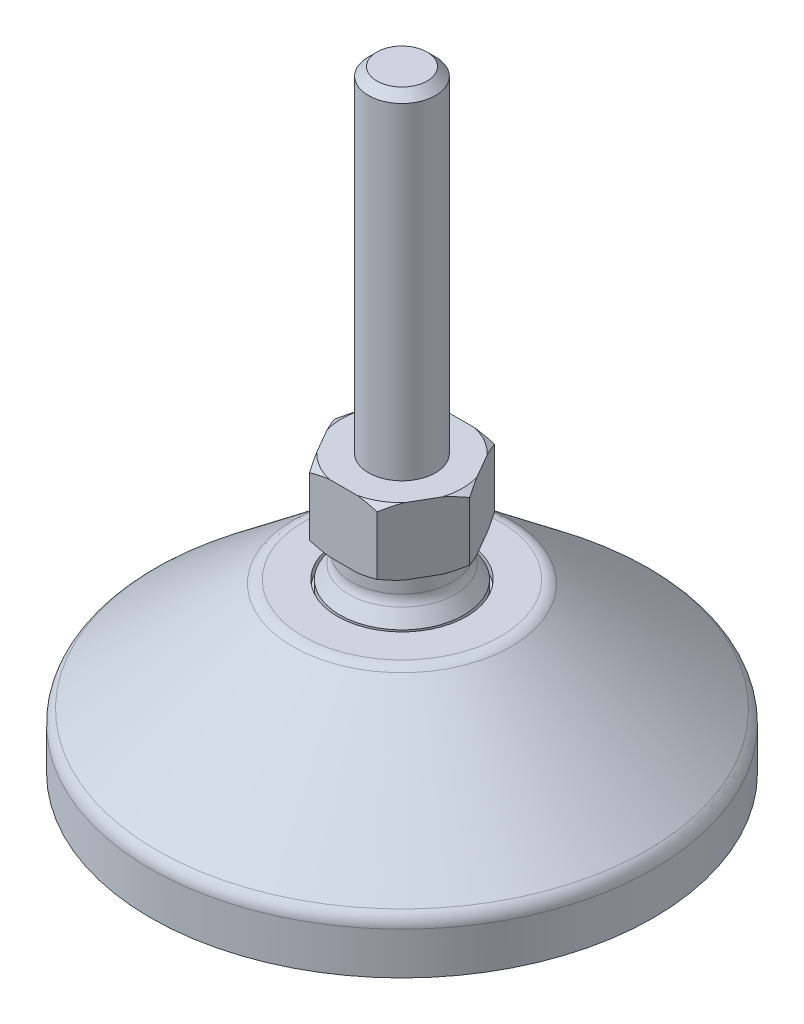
from build123d import *

# Parameters (mm, degrees)
SKETCH1_R           = 25.75
BOSS_EXTRUDE1_DEPTH = 2
SKETCH2_R           = 30
BOSS_EXTRUDE2_DEPTH = 6
SKETCH3_R           = 12.5
SKETCH4_R           = 7.4
SKETCH5_R           = 6
SKETCH11_R          = 7.7
SKETCH11_R_2        = 7.4
CUT_EXTRUDE1_DEPTH  = 1
SKETCH6_R           = 6
BOSS_EXTRUDE3_DEPTH = 2.9
SKETCH7_R           = 4
BOSS_EXTRUDE4_DEPTH = 48
SKETCH8_R           = 4
BOSS_EXTRUDE5_DEPTH = 8
CHAMFER1_SIZE       = 1
BOSS_EXTRUDE6_DEPTH = 1
FILLET1_R           = 2
FILLET2_R           = 2
FILLET3_R           = 1


with BuildPart() as part:
    # Sketch1 → Boss-Extrude1 (new body)
    with BuildSketch(Plane(origin=(0, 0, 0), x_dir=(1, 0, 0), z_dir=(0, 1, 0))):
        with Locations(Location((0, 0, 0), (0, 0, 270))):
            Circle(SKETCH1_R)
    extrude(amount=BOSS_EXTRUDE1_DEPTH)

    # Sketch2 → Boss-Extrude2 (add)
    with BuildSketch(Plane(origin=(0, 2, 0), x_dir=(1, 0, 0), z_dir=(0, 1, 0))):
        with Locations(Location((0, 0, 0), (0, 0, 270))):
            Circle(SKETCH2_R)
    extrude(amount=BOSS_EXTRUDE2_DEPTH)

    # Sketch3 → section 1 of loft1
    with BuildSketch(Plane(origin=(0, 22, 0), x_dir=(1, 0, 0), z_dir=(0, 1, 0)), mode=Mode.PRIVATE) as loft1_s1:
        Circle(SKETCH3_R)
    # loft up to a face of the part (loft1)
    loft([Face(Wire([part.edges().sort_by_distance((21.869058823, 8, -20.536413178))[0]])), loft1_s1.sketch])

    # Sketch4 → Loft2 section 0
    with BuildSketch(Plane(origin=(0, 22, 0), x_dir=(1, 0, 0), z_dir=(0, 1, 0))):
        Circle(SKETCH4_R)
    # Sketch5 → Loft2 section 1
    with BuildSketch(Plane(origin=(0, 24.1, 0), x_dir=(1, 0, 0), z_dir=(0, 1, 0))):
        Circle(SKETCH5_R)
    loft()

    # Sketch11 → Cut-Extrude1 (cut)
    with BuildSketch(Plane(origin=(0, 22, 0), x_dir=(1, 0, 0), z_dir=(0, 1, 0))):
        with Locations(Location((0, 0, 0), (0, 0, 270))):
            Circle(SKETCH11_R)
        with Locations(Location((0, 0, 0), (0, 0, 270))):
            Circle(SKETCH11_R_2, mode=Mode.SUBTRACT)
    extrude(amount=-CUT_EXTRUDE1_DEPTH, mode=Mode.SUBTRACT)

    # Sketch6 → Boss-Extrude3 (add)
    with BuildSketch(Plane(origin=(0, 24.1, 0), x_dir=(1, 0, 0), z_dir=(0, 1, 0))):
        with Locations(Location((0, 0, 0), (0, 0, 270))):
            Circle(SKETCH6_R)
    extrude(amount=BOSS_EXTRUDE3_DEPTH)

    # Sketch7 → Boss-Extrude4 (add)
    with BuildSketch(Plane(origin=(0, 27, 0), x_dir=(1, 0, 0), z_dir=(0, 1, 0))):
        with Locations(Location((0, 0, 0), (0, 0, 270))):
            Circle(SKETCH7_R)
    extrude(amount=BOSS_EXTRUDE4_DEPTH)

    # Sketch8 → Boss-Extrude5 (add)
    with BuildSketch(Plane(origin=(0, 27, 0), x_dir=(1, 0, 0), z_dir=(0, 1, 0))):
        Polygon((8.082903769, 0), (4.041451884, 7), (-4.041451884, 7), (-8.082903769, 0), (-4.041451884, -7), (4.041451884, -7), align=None)
        with Locations(Location((0, 0, 0), (0, 0, 270))):
            Circle(SKETCH8_R, mode=Mode.SUBTRACT)
    extrude(amount=BOSS_EXTRUDE5_DEPTH)

    # Sketch9 → Cut-Revolve1 (revolve, cut)
    with BuildSketch(Plane.XY, mode=Mode.PRIVATE) as cut_revolve1_sk:
        Polygon((-7.2, 35), (-8.082903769, 34.5), (-8.082903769, 35), align=None)
        Polygon((-8.082903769, 27.5), (-7.2, 27), (-8.082903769, 27), align=None)
    revolve(cut_revolve1_sk.sketch.rotate(Axis((0, 75, 0), (0, -1, 0)), 90), axis=Axis((0, 75, 0), (0, -1, 0)), mode=Mode.SUBTRACT)

    # Chamfer1
    chamfer1_edges = [part.edges().sort_by_distance(p)[0] for p in [
        (0, 75, -4),
    ]]
    chamfer(chamfer1_edges, length=CHAMFER1_SIZE)

    # Sketch10 → Boss-Extrude6 (add)
    with BuildSketch(Plane.XZ):
        with BuildLine():
            Line((3, 6), (20.645822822, 6))
            ThreePointArc((20.645822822, 6), (14.079230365, 16.248854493), (3, 21.289668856))
            Line((3, 21.289668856), (3, 6))
        make_face()
        with BuildLine():
            Line((-3, -21.289668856), (-3, -6))
            Line((-3, -6), (-20.645822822, -6))
            ThreePointArc((-20.645822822, -6), (-14.079230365, -16.248854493), (-3, -21.289668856))
        make_face()
        with BuildLine():
            Line((3, -21.289668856), (3, -6))
            Line((3, -6), (20.645822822, -6))
            ThreePointArc((20.645822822, -6), (14.079230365, -16.248854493), (3, -21.289668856))
        make_face()
        with BuildLine():
            Line((-20.645822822, 6), (-3, 6))
            Line((-3, 6), (-3, 21.289668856))
            ThreePointArc((-3, 21.289668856), (-14.079230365, 16.248854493), (-20.645822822, 6))
        make_face()
    extrude(amount=BOSS_EXTRUDE6_DEPTH)

    # Fillet1
    fillet1_edges = [part.edges().sort_by_distance(p)[0] for p in [
        (0, 22, -12.5),
        (0, 8, -30),
    ]]
    fillet(fillet1_edges, radius=FILLET1_R)

    # Fillet2
    fillet2_edges = [part.edges().sort_by_distance(p)[0] for p in [
        (-4.242640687, 24.1, -4.242640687),
    ]]
    fillet(fillet2_edges, radius=FILLET2_R)

    # Fillet3
    fillet3_edges = [part.edges().sort_by_distance(p)[0] for p in [
        (3, -0.5, 21.289668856),
        (3, -0.5, 6),
        (20.645822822, -0.5, 6),
        (-20.645822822, -0.5, -6),
        (-3, -0.5, -21.289668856),
        (-3, -0.5, -6),
        (-3, -0.5, 21.289668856),
        (-20.645822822, -0.5, 6),
        (-3, -0.5, 6),
        (3, -0.5, -21.289668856),
        (20.645822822, -0.5, -6),
        (3, -0.5, -6),
    ]]
    fillet(fillet3_edges, radius=FILLET3_R)


solid = part.part
